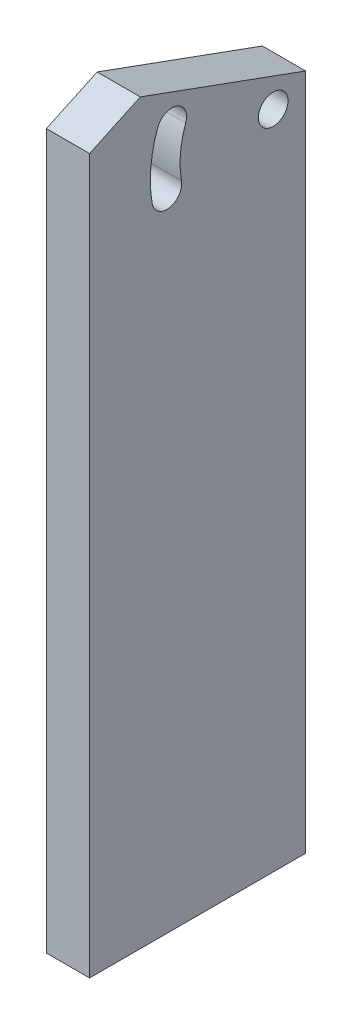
ISO-10303-21;
HEADER;
FILE_DESCRIPTION(('STEP AP214'),'2;1');
FILE_NAME('part.step','',(''),(''),'','','');
FILE_SCHEMA(('AUTOMOTIVE_DESIGN { 1 0 10303 214 1 1 1 1 }'));
ENDSEC;
DATA;
#1=APPLICATION_CONTEXT('core data for automotive mechanical design processes');
#2=APPLICATION_PROTOCOL_DEFINITION('international standard','automotive_design',2000,#1);
#3=PRODUCT_CONTEXT('',#1,'mechanical');
#4=PRODUCT('Part','Part','',(#3));
#5=PRODUCT_RELATED_PRODUCT_CATEGORY('part','',(#4));
#6=PRODUCT_DEFINITION_FORMATION('','',#4);
#7=PRODUCT_DEFINITION_CONTEXT('part definition',#1,'design');
#8=PRODUCT_DEFINITION('design','',#6,#7);
#9=PRODUCT_DEFINITION_SHAPE('','',#8);
#10=(LENGTH_UNIT() NAMED_UNIT(*) SI_UNIT(.MILLI.,.METRE.));
#11=(NAMED_UNIT(*) PLANE_ANGLE_UNIT() SI_UNIT($,.RADIAN.));
#12=(NAMED_UNIT(*) SI_UNIT($,.STERADIAN.) SOLID_ANGLE_UNIT());
#13=UNCERTAINTY_MEASURE_WITH_UNIT(LENGTH_MEASURE(1.E-05),#10,'distance_accuracy_value','');
#14=(GEOMETRIC_REPRESENTATION_CONTEXT(3) GLOBAL_UNCERTAINTY_ASSIGNED_CONTEXT((#13)) GLOBAL_UNIT_ASSIGNED_CONTEXT((#10,
#11,#12)) REPRESENTATION_CONTEXT('',''));
#15=CARTESIAN_POINT('',(0.,0.,0.));
#16=DIRECTION('',(0.,0.,1.));
#17=DIRECTION('',(1.,0.,0.));
#18=AXIS2_PLACEMENT_3D('',#15,#16,#17);
#19=CARTESIAN_POINT('',(4.,-59.9000000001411,12.));
#20=DIRECTION('',(0.,-1.,0.));
#21=DIRECTION('',(1.,0.,0.));
#22=AXIS2_PLACEMENT_3D('',#19,#20,#21);
#23=CONICAL_SURFACE('',#22,1.65000000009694,1.02974425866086);
#24=CARTESIAN_POINT('',(4.,-58.9085799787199,12.));
#25=VERTEX_POINT('',#24);
#26=VERTEX_LOOP('',#25);
#27=FACE_BOUND('',#26,.T.);
#28=CARTESIAN_POINT('',(4.,-59.9,12.));
#29=DIRECTION('',(0.,-1.,0.));
#30=DIRECTION('',(0.,0.,-1.));
#31=AXIS2_PLACEMENT_3D('',#28,#29,#30);
#32=CIRCLE('',#31,1.65);
#33=CARTESIAN_POINT('',(4.,-59.9,10.35));
#34=VERTEX_POINT('',#33);
#35=EDGE_CURVE('E151',#34,#34,#32,.T.);
#36=ORIENTED_EDGE('',*,*,#35,.T.);
#37=EDGE_LOOP('',(#36));
#38=FACE_BOUND('',#37,.T.);
#39=ADVANCED_FACE('F17',(#27,#38),#23,.F.);
#40=CARTESIAN_POINT('',(4.,-59.9000000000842,-12.));
#41=DIRECTION('',(0.,-1.,0.));
#42=DIRECTION('',(0.,0.,-1.));
#43=AXIS2_PLACEMENT_3D('',#40,#41,#42);
#44=CONICAL_SURFACE('',#43,1.64999999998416,1.02974425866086);
#45=CARTESIAN_POINT('',(4.,-58.9085799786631,-12.));
#46=VERTEX_POINT('',#45);
#47=VERTEX_LOOP('',#46);
#48=FACE_BOUND('',#47,.T.);
#49=CARTESIAN_POINT('',(4.,-59.9,-12.));
#50=DIRECTION('',(0.,-1.,0.));
#51=DIRECTION('',(0.,0.,-1.));
#52=AXIS2_PLACEMENT_3D('',#49,#50,#51);
#53=CIRCLE('',#52,1.65);
#54=CARTESIAN_POINT('',(4.,-59.9,-13.65));
#55=VERTEX_POINT('',#54);
#56=EDGE_CURVE('E148',#55,#55,#53,.T.);
#57=ORIENTED_EDGE('',*,*,#56,.T.);
#58=EDGE_LOOP('',(#57));
#59=FACE_BOUND('',#58,.T.);
#60=ADVANCED_FACE('F160',(#48,#59),#44,.F.);
#61=CARTESIAN_POINT('',(4.,-70.,12.));
#62=DIRECTION('',(0.,-1.,0.));
#63=DIRECTION('',(0.,0.,-1.));
#64=AXIS2_PLACEMENT_3D('',#61,#62,#63);
#65=CYLINDRICAL_SURFACE('',#64,1.65);
#66=ORIENTED_EDGE('',*,*,#35,.F.);
#67=EDGE_LOOP('',(#66));
#68=FACE_BOUND('',#67,.T.);
#69=CARTESIAN_POINT('',(4.,-70.,12.));
#70=DIRECTION('',(0.,-1.,0.));
#71=DIRECTION('',(0.,0.,-1.));
#72=AXIS2_PLACEMENT_3D('',#69,#70,#71);
#73=CIRCLE('',#72,1.65);
#74=CARTESIAN_POINT('',(4.,-70.,10.35));
#75=VERTEX_POINT('',#74);
#76=EDGE_CURVE('E131',#75,#75,#73,.T.);
#77=ORIENTED_EDGE('',*,*,#76,.T.);
#78=EDGE_LOOP('',(#77));
#79=FACE_BOUND('',#78,.T.);
#80=ADVANCED_FACE('F156',(#68,#79),#65,.F.);
#81=CARTESIAN_POINT('',(4.,-70.,-12.));
#82=DIRECTION('',(0.,-1.,0.));
#83=DIRECTION('',(0.,0.,-1.));
#84=AXIS2_PLACEMENT_3D('',#81,#82,#83);
#85=CYLINDRICAL_SURFACE('',#84,1.65);
#86=ORIENTED_EDGE('',*,*,#56,.F.);
#87=EDGE_LOOP('',(#86));
#88=FACE_BOUND('',#87,.T.);
#89=CARTESIAN_POINT('',(4.,-70.,-12.));
#90=DIRECTION('',(0.,-1.,0.));
#91=DIRECTION('',(0.,0.,-1.));
#92=AXIS2_PLACEMENT_3D('',#89,#90,#91);
#93=CIRCLE('',#92,1.65);
#94=CARTESIAN_POINT('',(4.,-70.,-13.65));
#95=VERTEX_POINT('',#94);
#96=EDGE_CURVE('E127',#95,#95,#93,.T.);
#97=ORIENTED_EDGE('',*,*,#96,.T.);
#98=EDGE_LOOP('',(#97));
#99=FACE_BOUND('',#98,.T.);
#100=ADVANCED_FACE('F159',(#88,#99),#85,.F.);
#101=CARTESIAN_POINT('',(8.,0.,0.));
#102=DIRECTION('',(1.,0.,0.));
#103=DIRECTION('',(0.,0.,-1.));
#104=AXIS2_PLACEMENT_3D('',#101,#102,#103);
#105=PLANE('',#104);
#106=DIRECTION('',(0.,0.,1.));
#107=VECTOR('',#106,1.);
#108=CARTESIAN_POINT('',(8.,-70.,20.));
#109=LINE('',#108,#107);
#110=CARTESIAN_POINT('',(8.,-70.,20.));
#111=VERTEX_POINT('',#110);
#112=CARTESIAN_POINT('',(8.,-70.,-20.));
#113=VERTEX_POINT('',#112);
#114=EDGE_CURVE('E130',#111,#113,#109,.F.);
#115=ORIENTED_EDGE('',*,*,#114,.T.);
#116=DIRECTION('',(0.,-1.,0.));
#117=VECTOR('',#116,1.);
#118=CARTESIAN_POINT('',(8.,70.,-20.));
#119=LINE('',#118,#117);
#120=CARTESIAN_POINT('',(8.,55.4411906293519,-20.));
#121=VERTEX_POINT('',#120);
#122=EDGE_CURVE('E220',#113,#121,#119,.F.);
#123=ORIENTED_EDGE('',*,*,#122,.T.);
#124=DIRECTION('',(0.,-0.34202014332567,-0.939692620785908));
#125=VECTOR('',#124,1.);
#126=CARTESIAN_POINT('',(8.,70.,20.));
#127=LINE('',#126,#125);
#128=CARTESIAN_POINT('',(8.,66.5797985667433,10.6030737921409));
#129=VERTEX_POINT('',#128);
#130=EDGE_CURVE('E205',#121,#129,#127,.F.);
#131=ORIENTED_EDGE('',*,*,#130,.T.);
#132=DIRECTION('',(0.,0.422618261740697,-0.906307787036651));
#133=VECTOR('',#132,1.);
#134=CARTESIAN_POINT('',(8.,62.1979399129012,20.));
#135=LINE('',#134,#133);
#136=CARTESIAN_POINT('',(8.,62.1979399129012,20.));
#137=VERTEX_POINT('',#136);
#138=EDGE_CURVE('E211',#129,#137,#135,.F.);
#139=ORIENTED_EDGE('',*,*,#138,.T.);
#140=DIRECTION('',(0.,1.,0.));
#141=VECTOR('',#140,1.);
#142=CARTESIAN_POINT('',(8.,70.,20.));
#143=LINE('',#142,#141);
#144=EDGE_CURVE('E102',#137,#111,#143,.F.);
#145=ORIENTED_EDGE('',*,*,#144,.T.);
#146=EDGE_LOOP('',(#115,#123,#131,#139,#145));
#147=FACE_BOUND('',#146,.T.);
#148=CARTESIAN_POINT('',(8.,52.3041231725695,-14.));
#149=DIRECTION('',(1.,0.,0.));
#150=DIRECTION('',(0.,0.,-1.));
#151=AXIS2_PLACEMENT_3D('',#148,#149,#150);
#152=CIRCLE('',#151,2.75);
#153=CARTESIAN_POINT('',(8.,52.3041231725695,-16.75));
#154=VERTEX_POINT('',#153);
#155=EDGE_CURVE('E110',#154,#154,#152,.F.);
#156=ORIENTED_EDGE('',*,*,#155,.T.);
#157=EDGE_LOOP('',(#156));
#158=FACE_BOUND('',#157,.T.);
#159=CARTESIAN_POINT('',(8.,52.3041231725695,-13.9999999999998));
#160=DIRECTION('',(1.,0.,0.));
#161=DIRECTION('',(0.,0.,-1.));
#162=AXIS2_PLACEMENT_3D('',#159,#160,#161);
#163=CIRCLE('',#162,22.75);
#164=CARTESIAN_POINT('',(8.,48.3536271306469,8.4043763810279));
#165=VERTEX_POINT('',#164);
#166=CARTESIAN_POINT('',(8.,60.0850814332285,7.37800712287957));
#167=VERTEX_POINT('',#166);
#168=EDGE_CURVE('E140',#165,#167,#163,.F.);
#169=ORIENTED_EDGE('',*,*,#168,.T.);
#170=CARTESIAN_POINT('',(8.,59.1445260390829,4.79385241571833));
#171=DIRECTION('',(1.,0.,0.));
#172=DIRECTION('',(0.,0.,-1.));
#173=AXIS2_PLACEMENT_3D('',#170,#171,#172);
#174=CIRCLE('',#173,2.75);
#175=CARTESIAN_POINT('',(8.,58.2039706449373,2.20969770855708));
#176=VERTEX_POINT('',#175);
#177=EDGE_CURVE('E138',#167,#176,#174,.F.);
#178=ORIENTED_EDGE('',*,*,#177,.T.);
#179=CARTESIAN_POINT('',(8.,52.3041231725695,-13.9999999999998));
#180=DIRECTION('',(1.,0.,0.));
#181=DIRECTION('',(0.,0.,-1.));
#182=AXIS2_PLACEMENT_3D('',#179,#180,#181);
#183=CIRCLE('',#182,17.25);
#184=CARTESIAN_POINT('',(8.,49.308692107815,2.98793373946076));
#185=VERTEX_POINT('',#184);
#186=EDGE_CURVE('E136',#185,#176,#183,.F.);
#187=ORIENTED_EDGE('',*,*,#186,.F.);
#188=CARTESIAN_POINT('',(8.,48.8311596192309,5.69615506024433));
#189=DIRECTION('',(1.,0.,0.));
#190=DIRECTION('',(0.,0.,-1.));
#191=AXIS2_PLACEMENT_3D('',#188,#189,#190);
#192=CIRCLE('',#191,2.75);
#193=EDGE_CURVE('E20',#185,#165,#192,.F.);
#194=ORIENTED_EDGE('',*,*,#193,.T.);
#195=EDGE_LOOP('',(#169,#178,#187,#194));
#196=FACE_BOUND('',#195,.T.);
#197=ADVANCED_FACE('F228',(#147,#158,#196),#105,.T.);
#198=CARTESIAN_POINT('',(0.,48.8311596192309,5.69615506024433));
#199=DIRECTION('',(1.,0.,0.));
#200=DIRECTION('',(0.,0.,-1.));
#201=AXIS2_PLACEMENT_3D('',#198,#199,#200);
#202=CYLINDRICAL_SURFACE('',#201,2.75);
#203=CARTESIAN_POINT('',(0.,48.8311596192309,5.69615506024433));
#204=DIRECTION('',(1.,0.,0.));
#205=DIRECTION('',(0.,0.,-1.));
#206=AXIS2_PLACEMENT_3D('',#203,#204,#205);
#207=CIRCLE('',#206,2.75);
#208=CARTESIAN_POINT('',(0.,49.308692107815,2.98793373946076));
#209=VERTEX_POINT('',#208);
#210=CARTESIAN_POINT('',(0.,48.3536271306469,8.4043763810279));
#211=VERTEX_POINT('',#210);
#212=EDGE_CURVE('E92',#209,#211,#207,.F.);
#213=ORIENTED_EDGE('',*,*,#212,.T.);
#214=DIRECTION('',(1.,0.,0.));
#215=VECTOR('',#214,1.);
#216=CARTESIAN_POINT('',(0.,48.3536271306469,8.4043763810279));
#217=LINE('',#216,#215);
#218=EDGE_CURVE('E141',#211,#165,#217,.T.);
#219=ORIENTED_EDGE('',*,*,#218,.T.);
#220=ORIENTED_EDGE('',*,*,#193,.F.);
#221=DIRECTION('',(1.,0.,0.));
#222=VECTOR('',#221,1.);
#223=CARTESIAN_POINT('',(0.,49.308692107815,2.98793373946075));
#224=LINE('',#223,#222);
#225=EDGE_CURVE('E105',#209,#185,#224,.T.);
#226=ORIENTED_EDGE('',*,*,#225,.F.);
#227=EDGE_LOOP('',(#213,#219,#220,#226));
#228=FACE_BOUND('',#227,.T.);
#229=ADVANCED_FACE('F106',(#228),#202,.F.);
#230=CARTESIAN_POINT('',(0.,52.3041231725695,-13.9999999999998));
#231=DIRECTION('',(1.,0.,0.));
#232=DIRECTION('',(0.,0.,-1.));
#233=AXIS2_PLACEMENT_3D('',#230,#231,#232);
#234=CYLINDRICAL_SURFACE('',#233,22.75);
#235=ORIENTED_EDGE('',*,*,#218,.F.);
#236=CARTESIAN_POINT('',(0.,52.3041231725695,-13.9999999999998));
#237=DIRECTION('',(1.,0.,0.));
#238=DIRECTION('',(0.,0.,-1.));
#239=AXIS2_PLACEMENT_3D('',#236,#237,#238);
#240=CIRCLE('',#239,22.75);
#241=CARTESIAN_POINT('',(0.,60.0850814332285,7.37800712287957));
#242=VERTEX_POINT('',#241);
#243=EDGE_CURVE('E99',#211,#242,#240,.F.);
#244=ORIENTED_EDGE('',*,*,#243,.T.);
#245=DIRECTION('',(1.,0.,0.));
#246=VECTOR('',#245,1.);
#247=CARTESIAN_POINT('',(0.,60.0850814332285,7.37800712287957));
#248=LINE('',#247,#246);
#249=EDGE_CURVE('E139',#242,#167,#248,.T.);
#250=ORIENTED_EDGE('',*,*,#249,.T.);
#251=ORIENTED_EDGE('',*,*,#168,.F.);
#252=EDGE_LOOP('',(#235,#244,#250,#251));
#253=FACE_BOUND('',#252,.T.);
#254=ADVANCED_FACE('F250',(#253),#234,.F.);
#255=CARTESIAN_POINT('',(0.,59.1445260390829,4.79385241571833));
#256=DIRECTION('',(1.,0.,0.));
#257=DIRECTION('',(0.,0.,-1.));
#258=AXIS2_PLACEMENT_3D('',#255,#256,#257);
#259=CYLINDRICAL_SURFACE('',#258,2.75);
#260=CARTESIAN_POINT('',(0.,59.1445260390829,4.79385241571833));
#261=DIRECTION('',(1.,0.,0.));
#262=DIRECTION('',(0.,0.,-1.));
#263=AXIS2_PLACEMENT_3D('',#260,#261,#262);
#264=CIRCLE('',#263,2.75);
#265=CARTESIAN_POINT('',(0.,58.2039706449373,2.20969770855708));
#266=VERTEX_POINT('',#265);
#267=EDGE_CURVE('E117',#242,#266,#264,.F.);
#268=ORIENTED_EDGE('',*,*,#267,.T.);
#269=DIRECTION('',(1.,0.,0.));
#270=VECTOR('',#269,1.);
#271=CARTESIAN_POINT('',(0.,58.2039706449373,2.20969770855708));
#272=LINE('',#271,#270);
#273=EDGE_CURVE('E111',#176,#266,#272,.F.);
#274=ORIENTED_EDGE('',*,*,#273,.F.);
#275=ORIENTED_EDGE('',*,*,#177,.F.);
#276=ORIENTED_EDGE('',*,*,#249,.F.);
#277=EDGE_LOOP('',(#268,#274,#275,#276));
#278=FACE_BOUND('',#277,.T.);
#279=ADVANCED_FACE('F308',(#278),#259,.F.);
#280=CARTESIAN_POINT('',(0.,52.3041231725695,-13.9999999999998));
#281=DIRECTION('',(1.,0.,0.));
#282=DIRECTION('',(0.,0.,-1.));
#283=AXIS2_PLACEMENT_3D('',#280,#281,#282);
#284=CYLINDRICAL_SURFACE('',#283,17.25);
#285=CARTESIAN_POINT('',(0.,52.3041231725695,-13.9999999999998));
#286=DIRECTION('',(1.,0.,0.));
#287=DIRECTION('',(0.,0.,-1.));
#288=AXIS2_PLACEMENT_3D('',#285,#286,#287);
#289=CIRCLE('',#288,17.25);
#290=EDGE_CURVE('E97',#266,#209,#289,.T.);
#291=ORIENTED_EDGE('',*,*,#290,.T.);
#292=ORIENTED_EDGE('',*,*,#225,.T.);
#293=ORIENTED_EDGE('',*,*,#186,.T.);
#294=ORIENTED_EDGE('',*,*,#273,.T.);
#295=EDGE_LOOP('',(#291,#292,#293,#294));
#296=FACE_BOUND('',#295,.T.);
#297=ADVANCED_FACE('F114',(#296),#284,.T.);
#298=CARTESIAN_POINT('',(0.,52.3041231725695,-14.));
#299=DIRECTION('',(1.,0.,0.));
#300=DIRECTION('',(0.,0.,-1.));
#301=AXIS2_PLACEMENT_3D('',#298,#299,#300);
#302=CYLINDRICAL_SURFACE('',#301,2.75);
#303=CARTESIAN_POINT('',(0.,52.3041231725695,-14.));
#304=DIRECTION('',(1.,0.,0.));
#305=DIRECTION('',(0.,0.,-1.));
#306=AXIS2_PLACEMENT_3D('',#303,#304,#305);
#307=CIRCLE('',#306,2.75);
#308=CARTESIAN_POINT('',(0.,52.3041231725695,-16.75));
#309=VERTEX_POINT('',#308);
#310=EDGE_CURVE('E116',#309,#309,#307,.F.);
#311=ORIENTED_EDGE('',*,*,#310,.T.);
#312=EDGE_LOOP('',(#311));
#313=FACE_BOUND('',#312,.T.);
#314=ORIENTED_EDGE('',*,*,#155,.F.);
#315=EDGE_LOOP('',(#314));
#316=FACE_BOUND('',#315,.T.);
#317=ADVANCED_FACE('F167',(#313,#316),#302,.F.);
#318=CARTESIAN_POINT('',(8.,-70.,20.));
#319=DIRECTION('',(0.,1.,0.));
#320=DIRECTION('',(0.,0.,1.));
#321=AXIS2_PLACEMENT_3D('',#318,#319,#320);
#322=PLANE('',#321);
#323=DIRECTION('',(1.,0.,0.));
#324=VECTOR('',#323,1.);
#325=CARTESIAN_POINT('',(8.,-70.,-20.));
#326=LINE('',#325,#324);
#327=CARTESIAN_POINT('',(0.,-70.,-20.));
#328=VERTEX_POINT('',#327);
#329=EDGE_CURVE('E222',#328,#113,#326,.T.);
#330=ORIENTED_EDGE('',*,*,#329,.T.);
#331=ORIENTED_EDGE('',*,*,#114,.F.);
#332=DIRECTION('',(1.,0.,0.));
#333=VECTOR('',#332,1.);
#334=CARTESIAN_POINT('',(8.,-70.,20.));
#335=LINE('',#334,#333);
#336=CARTESIAN_POINT('',(0.,-70.,20.));
#337=VERTEX_POINT('',#336);
#338=EDGE_CURVE('E213',#111,#337,#335,.F.);
#339=ORIENTED_EDGE('',*,*,#338,.T.);
#340=DIRECTION('',(0.,0.,-1.));
#341=VECTOR('',#340,1.);
#342=CARTESIAN_POINT('',(0.,-70.,0.));
#343=LINE('',#342,#341);
#344=EDGE_CURVE('E120',#337,#328,#343,.T.);
#345=ORIENTED_EDGE('',*,*,#344,.T.);
#346=EDGE_LOOP('',(#330,#331,#339,#345));
#347=FACE_BOUND('',#346,.T.);
#348=ORIENTED_EDGE('',*,*,#96,.F.);
#349=EDGE_LOOP('',(#348));
#350=FACE_BOUND('',#349,.T.);
#351=ORIENTED_EDGE('',*,*,#76,.F.);
#352=EDGE_LOOP('',(#351));
#353=FACE_BOUND('',#352,.T.);
#354=ADVANCED_FACE('F164',(#347,#350,#353),#322,.F.);
#355=CARTESIAN_POINT('',(8.,70.,-20.));
#356=DIRECTION('',(0.,0.,1.));
#357=DIRECTION('',(0.,-1.,0.));
#358=AXIS2_PLACEMENT_3D('',#355,#356,#357);
#359=PLANE('',#358);
#360=DIRECTION('',(1.,0.,0.));
#361=VECTOR('',#360,1.);
#362=CARTESIAN_POINT('',(0.,55.4411906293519,-20.));
#363=LINE('',#362,#361);
#364=CARTESIAN_POINT('',(0.,55.4411906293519,-20.));
#365=VERTEX_POINT('',#364);
#366=EDGE_CURVE('E215',#365,#121,#363,.T.);
#367=ORIENTED_EDGE('',*,*,#366,.T.);
#368=ORIENTED_EDGE('',*,*,#122,.F.);
#369=ORIENTED_EDGE('',*,*,#329,.F.);
#370=DIRECTION('',(0.,1.,0.));
#371=VECTOR('',#370,1.);
#372=CARTESIAN_POINT('',(0.,0.,-20.));
#373=LINE('',#372,#371);
#374=EDGE_CURVE('E235',#328,#365,#373,.T.);
#375=ORIENTED_EDGE('',*,*,#374,.T.);
#376=EDGE_LOOP('',(#367,#368,#369,#375));
#377=FACE_BOUND('',#376,.T.);
#378=ADVANCED_FACE('F166',(#377),#359,.F.);
#379=CARTESIAN_POINT('',(0.,70.,20.));
#380=DIRECTION('',(0.,-0.939692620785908,0.34202014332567));
#381=DIRECTION('',(0.,-0.34202014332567,-0.939692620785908));
#382=AXIS2_PLACEMENT_3D('',#379,#380,#381);
#383=PLANE('',#382);
#384=DIRECTION('',(1.,0.,0.));
#385=VECTOR('',#384,1.);
#386=CARTESIAN_POINT('',(8.,66.5797985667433,10.6030737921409));
#387=LINE('',#386,#385);
#388=CARTESIAN_POINT('',(0.,66.5797985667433,10.6030737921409));
#389=VERTEX_POINT('',#388);
#390=EDGE_CURVE('E204',#389,#129,#387,.T.);
#391=ORIENTED_EDGE('',*,*,#390,.T.);
#392=ORIENTED_EDGE('',*,*,#130,.F.);
#393=ORIENTED_EDGE('',*,*,#366,.F.);
#394=DIRECTION('',(0.,0.34202014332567,0.939692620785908));
#395=VECTOR('',#394,1.);
#396=CARTESIAN_POINT('',(0.,55.4411906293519,-20.));
#397=LINE('',#396,#395);
#398=EDGE_CURVE('E208',#365,#389,#397,.T.);
#399=ORIENTED_EDGE('',*,*,#398,.T.);
#400=EDGE_LOOP('',(#391,#392,#393,#399));
#401=FACE_BOUND('',#400,.T.);
#402=ADVANCED_FACE('F175',(#401),#383,.F.);
#403=CARTESIAN_POINT('',(8.,62.1979399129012,20.));
#404=DIRECTION('',(0.,-0.906307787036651,-0.422618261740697));
#405=DIRECTION('',(0.,0.422618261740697,-0.906307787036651));
#406=AXIS2_PLACEMENT_3D('',#403,#404,#405);
#407=PLANE('',#406);
#408=ORIENTED_EDGE('',*,*,#390,.F.);
#409=DIRECTION('',(0.,-0.422618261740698,0.90630778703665));
#410=VECTOR('',#409,1.);
#411=CARTESIAN_POINT('',(0.,66.5797985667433,10.6030737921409));
#412=LINE('',#411,#410);
#413=CARTESIAN_POINT('',(0.,62.1979399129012,20.));
#414=VERTEX_POINT('',#413);
#415=EDGE_CURVE('E26',#389,#414,#412,.T.);
#416=ORIENTED_EDGE('',*,*,#415,.T.);
#417=DIRECTION('',(1.,0.,0.));
#418=VECTOR('',#417,1.);
#419=CARTESIAN_POINT('',(8.,62.1979399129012,20.));
#420=LINE('',#419,#418);
#421=EDGE_CURVE('E34',#414,#137,#420,.T.);
#422=ORIENTED_EDGE('',*,*,#421,.T.);
#423=ORIENTED_EDGE('',*,*,#138,.F.);
#424=EDGE_LOOP('',(#408,#416,#422,#423));
#425=FACE_BOUND('',#424,.T.);
#426=ADVANCED_FACE('F189',(#425),#407,.F.);
#427=CARTESIAN_POINT('',(8.,70.,20.));
#428=DIRECTION('',(0.,0.,-1.));
#429=DIRECTION('',(0.,1.,0.));
#430=AXIS2_PLACEMENT_3D('',#427,#428,#429);
#431=PLANE('',#430);
#432=ORIENTED_EDGE('',*,*,#421,.F.);
#433=DIRECTION('',(0.,1.,0.));
#434=VECTOR('',#433,1.);
#435=CARTESIAN_POINT('',(0.,0.,20.));
#436=LINE('',#435,#434);
#437=EDGE_CURVE('E11',#414,#337,#436,.F.);
#438=ORIENTED_EDGE('',*,*,#437,.T.);
#439=ORIENTED_EDGE('',*,*,#338,.F.);
#440=ORIENTED_EDGE('',*,*,#144,.F.);
#441=EDGE_LOOP('',(#432,#438,#439,#440));
#442=FACE_BOUND('',#441,.T.);
#443=ADVANCED_FACE('F183',(#442),#431,.F.);
#444=CARTESIAN_POINT('',(0.,0.,0.));
#445=DIRECTION('',(1.,0.,0.));
#446=DIRECTION('',(0.,0.,-1.));
#447=AXIS2_PLACEMENT_3D('',#444,#445,#446);
#448=PLANE('',#447);
#449=ORIENTED_EDGE('',*,*,#415,.F.);
#450=ORIENTED_EDGE('',*,*,#398,.F.);
#451=ORIENTED_EDGE('',*,*,#374,.F.);
#452=ORIENTED_EDGE('',*,*,#344,.F.);
#453=ORIENTED_EDGE('',*,*,#437,.F.);
#454=EDGE_LOOP('',(#449,#450,#451,#452,#453));
#455=FACE_BOUND('',#454,.T.);
#456=ORIENTED_EDGE('',*,*,#310,.F.);
#457=EDGE_LOOP('',(#456));
#458=FACE_BOUND('',#457,.T.);
#459=ORIENTED_EDGE('',*,*,#290,.F.);
#460=ORIENTED_EDGE('',*,*,#267,.F.);
#461=ORIENTED_EDGE('',*,*,#243,.F.);
#462=ORIENTED_EDGE('',*,*,#212,.F.);
#463=EDGE_LOOP('',(#459,#460,#461,#462));
#464=FACE_BOUND('',#463,.T.);
#465=ADVANCED_FACE('F94',(#455,#458,#464),#448,.F.);
#466=CLOSED_SHELL('',(#39,#60,#80,#100,#197,#229,#254,#279,#297,#317,#354,#378,#402,#426,#443,#465));
#467=MANIFOLD_SOLID_BREP('B1',#466);
#468=ADVANCED_BREP_SHAPE_REPRESENTATION('',(#18,#467),#14);
#469=SHAPE_DEFINITION_REPRESENTATION(#9,#468);
ENDSEC;
END-ISO-10303-21;
